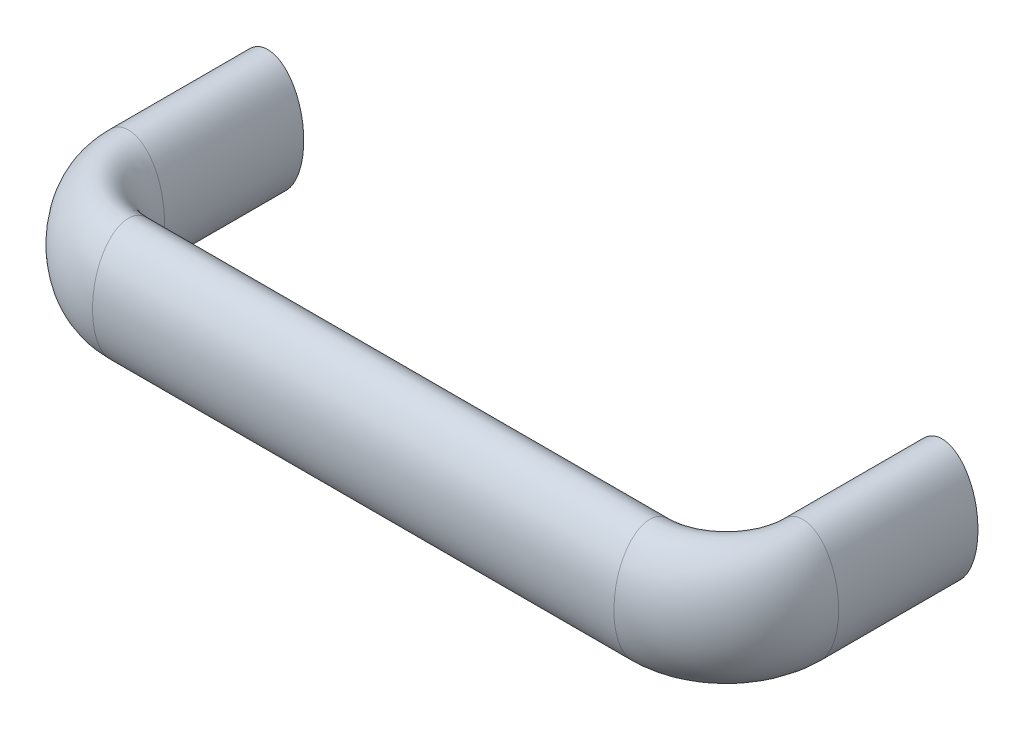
ISO-10303-21;
HEADER;
FILE_DESCRIPTION(('STEP AP214'),'2;1');
FILE_NAME('part.step','',(''),(''),'','','');
FILE_SCHEMA(('AUTOMOTIVE_DESIGN { 1 0 10303 214 1 1 1 1 }'));
ENDSEC;
DATA;
#1=APPLICATION_CONTEXT('core data for automotive mechanical design processes');
#2=APPLICATION_PROTOCOL_DEFINITION('international standard','automotive_design',2000,#1);
#3=PRODUCT_CONTEXT('',#1,'mechanical');
#4=PRODUCT('Part','Part','',(#3));
#5=PRODUCT_RELATED_PRODUCT_CATEGORY('part','',(#4));
#6=PRODUCT_DEFINITION_FORMATION('','',#4);
#7=PRODUCT_DEFINITION_CONTEXT('part definition',#1,'design');
#8=PRODUCT_DEFINITION('design','',#6,#7);
#9=PRODUCT_DEFINITION_SHAPE('','',#8);
#10=(LENGTH_UNIT() NAMED_UNIT(*) SI_UNIT(.MILLI.,.METRE.));
#11=(NAMED_UNIT(*) PLANE_ANGLE_UNIT() SI_UNIT($,.RADIAN.));
#12=(NAMED_UNIT(*) SI_UNIT($,.STERADIAN.) SOLID_ANGLE_UNIT());
#13=UNCERTAINTY_MEASURE_WITH_UNIT(LENGTH_MEASURE(1.E-05),#10,'distance_accuracy_value','');
#14=(GEOMETRIC_REPRESENTATION_CONTEXT(3) GLOBAL_UNCERTAINTY_ASSIGNED_CONTEXT((#13)) GLOBAL_UNIT_ASSIGNED_CONTEXT((#10,
#11,#12)) REPRESENTATION_CONTEXT('',''));
#15=CARTESIAN_POINT('',(0.,0.,0.));
#16=DIRECTION('',(0.,0.,1.));
#17=DIRECTION('',(1.,0.,0.));
#18=AXIS2_PLACEMENT_3D('',#15,#16,#17);
#19=CARTESIAN_POINT('',(150.,0.,0.));
#20=DIRECTION('',(0.,0.,-1.));
#21=DIRECTION('',(-1.,0.,0.));
#22=AXIS2_PLACEMENT_3D('',#19,#20,#21);
#23=PLANE('',#22);
#24=CARTESIAN_POINT('',(150.,0.,0.));
#25=DIRECTION('',(0.,0.,-1.));
#26=DIRECTION('',(0.,1.,0.));
#27=AXIS2_PLACEMENT_3D('',#24,#25,#26);
#28=ELLIPSE('',#27,13.5,8.);
#29=CARTESIAN_POINT('',(150.,13.5,0.));
#30=VERTEX_POINT('',#29);
#31=EDGE_CURVE('E8',#30,#30,#28,.T.);
#32=ORIENTED_EDGE('',*,*,#31,.T.);
#33=EDGE_LOOP('',(#32));
#34=FACE_BOUND('',#33,.T.);
#35=CARTESIAN_POINT('',(150.,0.,0.));
#36=DIRECTION('',(0.,0.,1.));
#37=DIRECTION('',(1.,0.,0.));
#38=AXIS2_PLACEMENT_3D('',#35,#36,#37);
#39=CIRCLE('',#38,4.);
#40=CARTESIAN_POINT('',(154.,0.,0.));
#41=VERTEX_POINT('',#40);
#42=EDGE_CURVE('E67',#41,#41,#39,.T.);
#43=ORIENTED_EDGE('',*,*,#42,.T.);
#44=EDGE_LOOP('',(#43));
#45=FACE_BOUND('',#44,.T.);
#46=ADVANCED_FACE('F12',(#34,#45),#23,.T.);
#47=CARTESIAN_POINT('',(0.,0.,0.));
#48=DIRECTION('',(0.,0.,1.));
#49=DIRECTION('',(1.,0.,0.));
#50=AXIS2_PLACEMENT_3D('',#47,#48,#49);
#51=PLANE('',#50);
#52=CARTESIAN_POINT('',(0.,0.,0.));
#53=DIRECTION('',(0.,0.,1.));
#54=DIRECTION('',(0.,1.,0.));
#55=AXIS2_PLACEMENT_3D('',#52,#53,#54);
#56=ELLIPSE('',#55,13.5,8.);
#57=CARTESIAN_POINT('',(0.,13.5,0.));
#58=VERTEX_POINT('',#57);
#59=EDGE_CURVE('E53',#58,#58,#56,.T.);
#60=ORIENTED_EDGE('',*,*,#59,.F.);
#61=EDGE_LOOP('',(#60));
#62=FACE_BOUND('',#61,.T.);
#63=CARTESIAN_POINT('',(0.,0.,0.));
#64=DIRECTION('',(0.,0.,1.));
#65=DIRECTION('',(1.,0.,0.));
#66=AXIS2_PLACEMENT_3D('',#63,#64,#65);
#67=CIRCLE('',#66,4.);
#68=CARTESIAN_POINT('',(4.,0.,0.));
#69=VERTEX_POINT('',#68);
#70=EDGE_CURVE('E54',#69,#69,#67,.T.);
#71=ORIENTED_EDGE('',*,*,#70,.T.);
#72=EDGE_LOOP('',(#71));
#73=FACE_BOUND('',#72,.T.);
#74=ADVANCED_FACE('F86',(#62,#73),#51,.F.);
#75=CARTESIAN_POINT('',(150.,0.,31.));
#76=DIRECTION('',(0.,0.,-1.));
#77=DIRECTION('',(0.,1.,0.));
#78=AXIS2_PLACEMENT_3D('',#75,#76,#77);
#79=ELLIPSE('',#78,13.5,8.);
#80=DIRECTION('',(0.,0.,-1.));
#81=VECTOR('',#80,1.);
#82=SURFACE_OF_LINEAR_EXTRUSION('',#79,#81);
#83=CARTESIAN_POINT('',(150.,13.5,31.));
#84=VERTEX_POINT('',#83);
#85=EDGE_CURVE('E19',#84,#84,#79,.T.);
#86=ORIENTED_EDGE('',*,*,#85,.T.);
#87=EDGE_LOOP('',(#86));
#88=FACE_BOUND('',#87,.T.);
#89=ORIENTED_EDGE('',*,*,#31,.F.);
#90=EDGE_LOOP('',(#89));
#91=FACE_BOUND('',#90,.T.);
#92=ADVANCED_FACE('F14',(#88,#91),#82,.T.);
#93=CARTESIAN_POINT('',(133.,0.,48.));
#94=DIRECTION('',(1.,0.,0.));
#95=DIRECTION('',(0.,1.,0.));
#96=AXIS2_PLACEMENT_3D('',#93,#94,#95);
#97=ELLIPSE('',#96,13.5,8.);
#98=CARTESIAN_POINT('',(133.,0.,31.));
#99=DIRECTION('',(0.,1.,0.));
#100=AXIS1_PLACEMENT('',#98,#99);
#101=SURFACE_OF_REVOLUTION('',#97,#100);
#102=CARTESIAN_POINT('',(133.,13.5,48.));
#103=VERTEX_POINT('',#102);
#104=EDGE_CURVE('E23',#103,#103,#97,.T.);
#105=ORIENTED_EDGE('',*,*,#104,.T.);
#106=EDGE_LOOP('',(#105));
#107=FACE_BOUND('',#106,.T.);
#108=ORIENTED_EDGE('',*,*,#85,.F.);
#109=EDGE_LOOP('',(#108));
#110=FACE_BOUND('',#109,.T.);
#111=ADVANCED_FACE('F34',(#107,#110),#101,.F.);
#112=CARTESIAN_POINT('',(17.,0.,48.));
#113=DIRECTION('',(1.,0.,0.));
#114=DIRECTION('',(0.,1.,0.));
#115=AXIS2_PLACEMENT_3D('',#112,#113,#114);
#116=ELLIPSE('',#115,13.5,8.);
#117=DIRECTION('',(1.,0.,0.));
#118=VECTOR('',#117,1.);
#119=SURFACE_OF_LINEAR_EXTRUSION('',#116,#118);
#120=CARTESIAN_POINT('',(17.,13.5,48.));
#121=VERTEX_POINT('',#120);
#122=EDGE_CURVE('E27',#121,#121,#116,.T.);
#123=ORIENTED_EDGE('',*,*,#122,.T.);
#124=EDGE_LOOP('',(#123));
#125=FACE_BOUND('',#124,.T.);
#126=ORIENTED_EDGE('',*,*,#104,.F.);
#127=EDGE_LOOP('',(#126));
#128=FACE_BOUND('',#127,.T.);
#129=ADVANCED_FACE('F37',(#125,#128),#119,.T.);
#130=CARTESIAN_POINT('',(0.,0.,31.));
#131=DIRECTION('',(0.,0.,1.));
#132=DIRECTION('',(0.,1.,0.));
#133=AXIS2_PLACEMENT_3D('',#130,#131,#132);
#134=ELLIPSE('',#133,13.5,8.);
#135=CARTESIAN_POINT('',(17.,0.,31.));
#136=DIRECTION('',(0.,1.,0.));
#137=AXIS1_PLACEMENT('',#135,#136);
#138=SURFACE_OF_REVOLUTION('',#134,#137);
#139=CARTESIAN_POINT('',(0.,13.5,31.));
#140=VERTEX_POINT('',#139);
#141=EDGE_CURVE('E49',#140,#140,#134,.T.);
#142=ORIENTED_EDGE('',*,*,#141,.T.);
#143=EDGE_LOOP('',(#142));
#144=FACE_BOUND('',#143,.T.);
#145=ORIENTED_EDGE('',*,*,#122,.F.);
#146=EDGE_LOOP('',(#145));
#147=FACE_BOUND('',#146,.T.);
#148=ADVANCED_FACE('F41',(#144,#147),#138,.F.);
#149=DIRECTION('',(0.,0.,-1.));
#150=VECTOR('',#149,1.);
#151=SURFACE_OF_LINEAR_EXTRUSION('',#134,#150);
#152=ORIENTED_EDGE('',*,*,#141,.F.);
#153=EDGE_LOOP('',(#152));
#154=FACE_BOUND('',#153,.T.);
#155=ORIENTED_EDGE('',*,*,#59,.T.);
#156=EDGE_LOOP('',(#155));
#157=FACE_BOUND('',#156,.T.);
#158=ADVANCED_FACE('F46',(#154,#157),#151,.F.);
#159=CARTESIAN_POINT('',(0.,0.,13.));
#160=DIRECTION('',(0.,0.,-1.));
#161=DIRECTION('',(-1.,0.,0.));
#162=AXIS2_PLACEMENT_3D('',#159,#160,#161);
#163=CYLINDRICAL_SURFACE('',#162,4.);
#164=CARTESIAN_POINT('',(0.,0.,13.));
#165=DIRECTION('',(0.,0.,1.));
#166=DIRECTION('',(1.,0.,0.));
#167=AXIS2_PLACEMENT_3D('',#164,#165,#166);
#168=CIRCLE('',#167,4.);
#169=CARTESIAN_POINT('',(4.,0.,13.));
#170=VERTEX_POINT('',#169);
#171=EDGE_CURVE('E58',#170,#170,#168,.T.);
#172=ORIENTED_EDGE('',*,*,#171,.T.);
#173=EDGE_LOOP('',(#172));
#174=FACE_BOUND('',#173,.T.);
#175=ORIENTED_EDGE('',*,*,#70,.F.);
#176=EDGE_LOOP('',(#175));
#177=FACE_BOUND('',#176,.T.);
#178=ADVANCED_FACE('F94',(#174,#177),#163,.F.);
#179=CARTESIAN_POINT('',(0.,0.,13.));
#180=DIRECTION('',(0.,0.,1.));
#181=DIRECTION('',(1.,0.,0.));
#182=AXIS2_PLACEMENT_3D('',#179,#180,#181);
#183=PLANE('',#182);
#184=ORIENTED_EDGE('',*,*,#171,.F.);
#185=EDGE_LOOP('',(#184));
#186=FACE_BOUND('',#185,.T.);
#187=ADVANCED_FACE('F83',(#186),#183,.F.);
#188=CARTESIAN_POINT('',(150.,0.,13.));
#189=DIRECTION('',(0.,0.,-1.));
#190=DIRECTION('',(-1.,0.,0.));
#191=AXIS2_PLACEMENT_3D('',#188,#189,#190);
#192=CYLINDRICAL_SURFACE('',#191,4.);
#193=CARTESIAN_POINT('',(150.,0.,13.));
#194=DIRECTION('',(0.,0.,1.));
#195=DIRECTION('',(1.,0.,0.));
#196=AXIS2_PLACEMENT_3D('',#193,#194,#195);
#197=CIRCLE('',#196,4.);
#198=CARTESIAN_POINT('',(154.,0.,13.));
#199=VERTEX_POINT('',#198);
#200=EDGE_CURVE('E65',#199,#199,#197,.T.);
#201=ORIENTED_EDGE('',*,*,#200,.T.);
#202=EDGE_LOOP('',(#201));
#203=FACE_BOUND('',#202,.T.);
#204=ORIENTED_EDGE('',*,*,#42,.F.);
#205=EDGE_LOOP('',(#204));
#206=FACE_BOUND('',#205,.T.);
#207=ADVANCED_FACE('F73',(#203,#206),#192,.F.);
#208=CARTESIAN_POINT('',(150.,0.,13.));
#209=DIRECTION('',(0.,0.,1.));
#210=DIRECTION('',(1.,0.,0.));
#211=AXIS2_PLACEMENT_3D('',#208,#209,#210);
#212=PLANE('',#211);
#213=ORIENTED_EDGE('',*,*,#200,.F.);
#214=EDGE_LOOP('',(#213));
#215=FACE_BOUND('',#214,.T.);
#216=ADVANCED_FACE('F76',(#215),#212,.F.);
#217=CLOSED_SHELL('',(#46,#74,#92,#111,#129,#148,#158,#178,#187,#207,#216));
#218=MANIFOLD_SOLID_BREP('B1',#217);
#219=ADVANCED_BREP_SHAPE_REPRESENTATION('',(#18,#218),#14);
#220=SHAPE_DEFINITION_REPRESENTATION(#9,#219);
ENDSEC;
END-ISO-10303-21;
